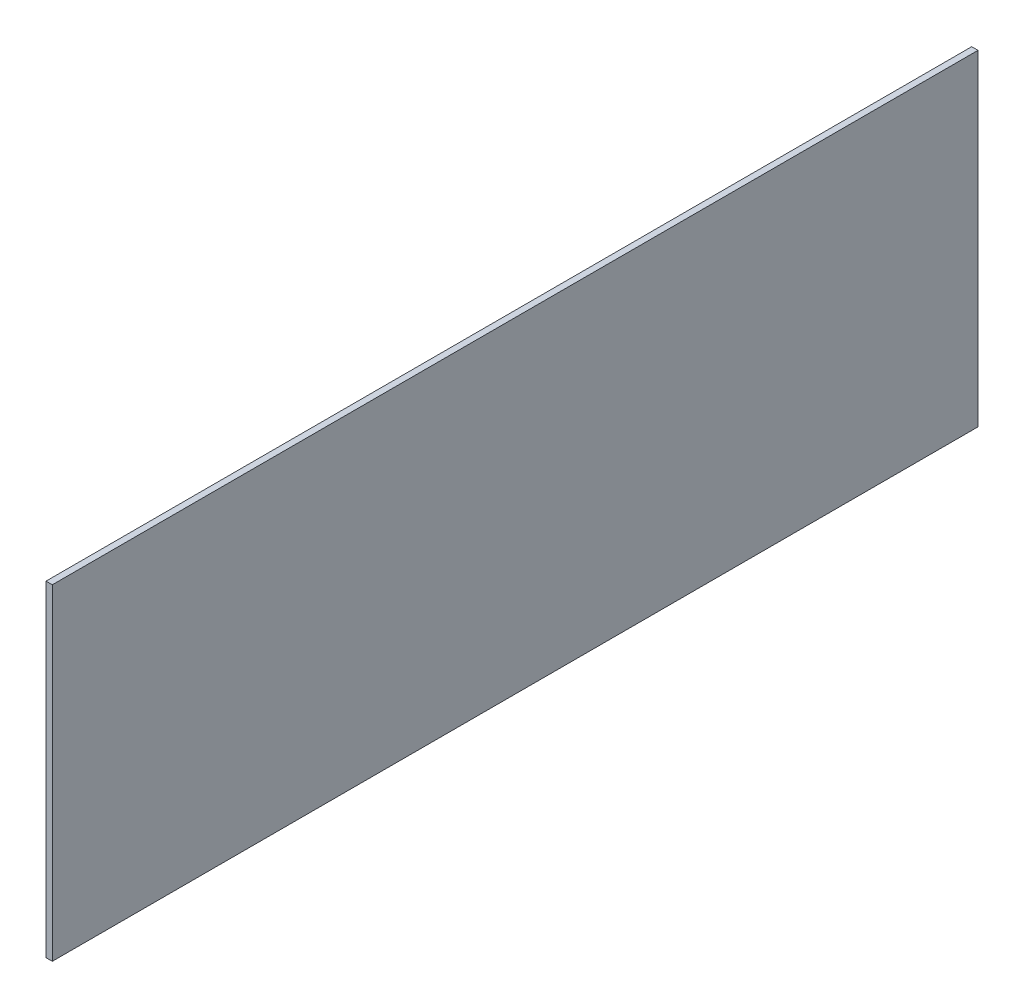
from build123d import *

# Parameters (mm, degrees)
SKETCH1_W           = 440
SKETCH1_H           = 155
BOSS_EXTRUDE1_DEPTH = 3


with BuildPart() as part:
    # Sketch1 → Boss-Extrude1 (new body)
    with BuildSketch(Plane(origin=(0, 0, 0), x_dir=(0, 0, -1), z_dir=(1, 0, 0))):
        with Locations((220, 77.5)):
            Rectangle(SKETCH1_W, SKETCH1_H)
    extrude(amount=BOSS_EXTRUDE1_DEPTH)


solid = part.part
